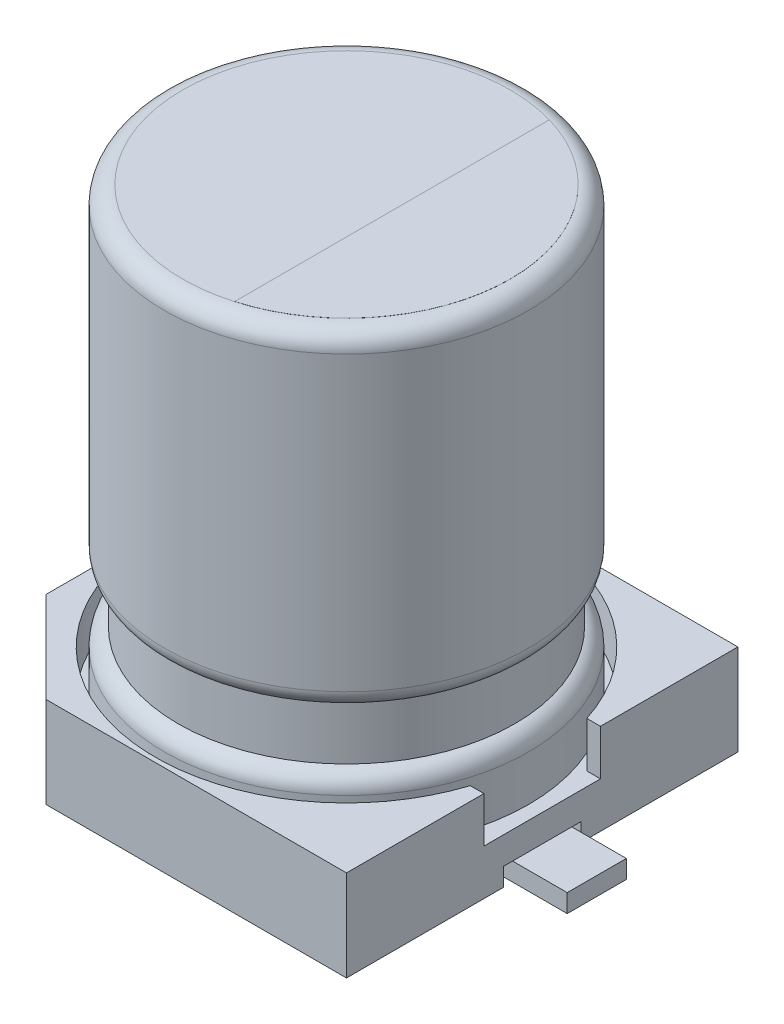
from build123d import *

# Parameters (mm, degrees)
EXTRUDE_5_DEPTH     = 0.001
EXTRUDE_1_DEPTH     = 0.5
EXTRUDE_2_DEPTH     = 0.5
SKETCH_4_W          = 1.75
SKETCH_4_H          = 0.85
CUT_EXTRUDE_3_DEPTH = 0.2
SKETCH_5_W          = 2.25
SKETCH_5_H          = 0.65
EXTRUDE_4_DEPTH     = 0.2


with BuildPart() as part:
    # Sketch 1 → Revolve 1 (revolve)
    with BuildSketch(Plane.XY):
        with BuildLine():
            Line((0, 0), (-2, 0))
            Line((-2, 0), (-2, 1))
            ThreePointArc((-2, 1), (-1.958113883, 1.122474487), (-1.85, 1.193649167))
            Line((-1.85, 1.193649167), (-1.85, 1.793649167))
            ThreePointArc((-1.85, 1.793649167), (-1.958113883, 1.864823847), (-2, 1.987298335))
            Line((-2, 1.987298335), (-2, 5.2))
            ThreePointArc((-2, 5.2), (-1.941421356, 5.341421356), (-1.8, 5.4))
            Line((-1.8, 5.4), (0, 5.4))
            Line((0, 5.4), (0, 0))
        make_face()
    revolve(axis=Axis((0, 5.4, 0), (0, -1, 0)))

    # Sketch 6 → Extrude 5 (add)
    with BuildSketch(Plane(origin=(0, 5.4, 0), x_dir=(1, 0, 0), z_dir=(0, 1, 0))):
        with BuildLine():
            Line((0.5, 1.729161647), (0.5, -1.729161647))
            ThreePointArc((0.5, -1.729161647), (1.8, 0), (0.5, 1.729161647))
        make_face()
    extrude(amount=EXTRUDE_5_DEPTH)

    # Sketch 2 → Extrude 1 (add)
    with BuildSketch(Plane(origin=(0, 0, 0), x_dir=(1, 0, 0), z_dir=(0, 1, 0))):
        Polygon((-1.15, 2.15), (-2.15, 1.15), (-2.15, -1.15), (-1.15, -2.15), (2.15, -2.15), (2.15, 2.15), align=None)
    extrude(amount=EXTRUDE_1_DEPTH)

    # Sketch 3 → Extrude 2 (add)
    with BuildSketch(Plane(origin=(0, 0.5, 0), x_dir=(1, 0, 0), z_dir=(0, 1, 0))):
        with BuildLine():
            Line((-2.15, -0.640312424), (-2.15, -1.15))
            Line((-2.15, -1.15), (-1.15, -2.15))
            Line((-1.15, -2.15), (2.15, -2.15))
            Line((2.15, -2.15), (2.15, -0.640312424))
            Line((2.15, -0.640312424), (2, -0.640312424))
            ThreePointArc((2, -0.640312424), (0, -2.1), (-2, -0.640312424))
            Line((-2, -0.640312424), (-2.15, -0.640312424))
        make_face()
        with BuildLine():
            Line((-2.15, 0.640312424), (-2, 0.640312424))
            ThreePointArc((-2, 0.640312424), (0, 2.1), (2, 0.640312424))
            Line((2, 0.640312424), (2.15, 0.640312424))
            Line((2.15, 0.640312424), (2.15, 2.15))
            Line((2.15, 2.15), (-1.15, 2.15))
            Line((-1.15, 2.15), (-2.15, 1.15))
            Line((-2.15, 1.15), (-2.15, 0.640312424))
        make_face()
    extrude(amount=EXTRUDE_2_DEPTH)

    # Sketch 4 → Cut-Extrude 3 (cut)
    with BuildSketch(Plane.XZ):
        with Locations((-1.275, 0)):
            Rectangle(SKETCH_4_W, SKETCH_4_H)
        with Locations((1.275, 0)):
            Rectangle(SKETCH_4_W, SKETCH_4_H)
    extrude(amount=-CUT_EXTRUDE_3_DEPTH, mode=Mode.SUBTRACT)

    # Sketch 5 → Extrude 4 (add)
    with BuildSketch(Plane(origin=(0, 0, 0), x_dir=(1, 0, 0), z_dir=(0, 1, 0))):
        with Locations((-1.625, 0)):
            Rectangle(SKETCH_5_W, SKETCH_5_H)
        with Locations((1.625, 0)):
            Rectangle(SKETCH_5_W, SKETCH_5_H)
    extrude(amount=EXTRUDE_4_DEPTH)


solid = part.part
